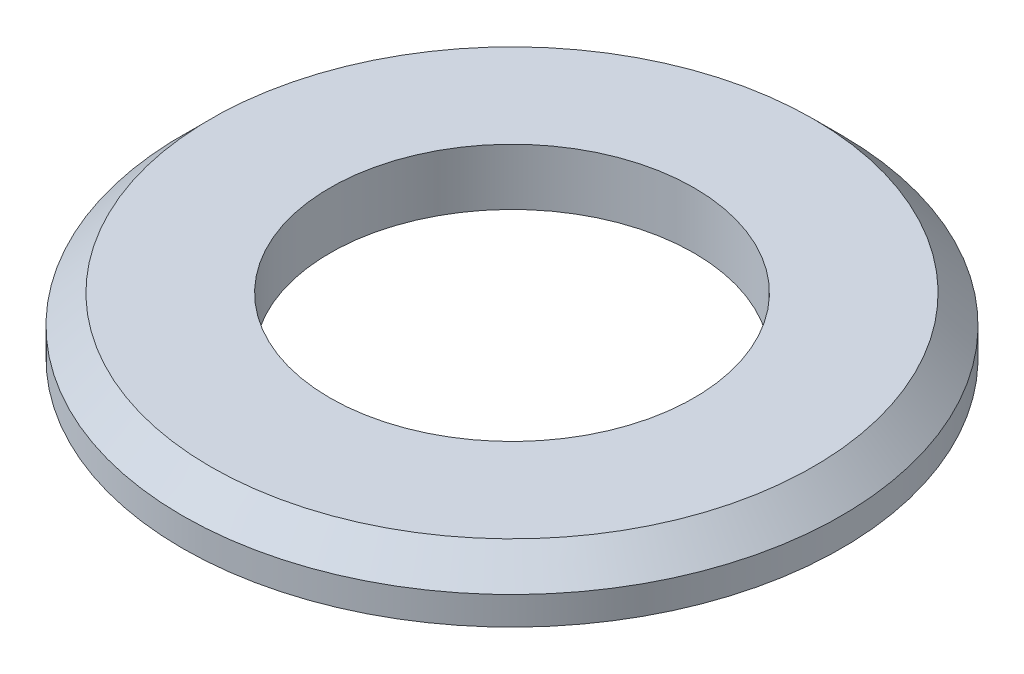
ISO-10303-21;
HEADER;
FILE_DESCRIPTION(('STEP AP214'),'2;1');
FILE_NAME('part.step','',(''),(''),'','','');
FILE_SCHEMA(('AUTOMOTIVE_DESIGN { 1 0 10303 214 1 1 1 1 }'));
ENDSEC;
DATA;
#1=APPLICATION_CONTEXT('core data for automotive mechanical design processes');
#2=APPLICATION_PROTOCOL_DEFINITION('international standard','automotive_design',2000,#1);
#3=PRODUCT_CONTEXT('',#1,'mechanical');
#4=PRODUCT('Part','Part','',(#3));
#5=PRODUCT_RELATED_PRODUCT_CATEGORY('part','',(#4));
#6=PRODUCT_DEFINITION_FORMATION('','',#4);
#7=PRODUCT_DEFINITION_CONTEXT('part definition',#1,'design');
#8=PRODUCT_DEFINITION('design','',#6,#7);
#9=PRODUCT_DEFINITION_SHAPE('','',#8);
#10=(LENGTH_UNIT() NAMED_UNIT(*) SI_UNIT(.MILLI.,.METRE.));
#11=(NAMED_UNIT(*) PLANE_ANGLE_UNIT() SI_UNIT($,.RADIAN.));
#12=(NAMED_UNIT(*) SI_UNIT($,.STERADIAN.) SOLID_ANGLE_UNIT());
#13=UNCERTAINTY_MEASURE_WITH_UNIT(LENGTH_MEASURE(1.E-05),#10,'distance_accuracy_value','');
#14=(GEOMETRIC_REPRESENTATION_CONTEXT(3) GLOBAL_UNCERTAINTY_ASSIGNED_CONTEXT((#13)) GLOBAL_UNIT_ASSIGNED_CONTEXT((#10,
#11,#12)) REPRESENTATION_CONTEXT('',''));
#15=CARTESIAN_POINT('',(0.,0.,0.));
#16=DIRECTION('',(0.,0.,1.));
#17=DIRECTION('',(1.,0.,0.));
#18=AXIS2_PLACEMENT_3D('',#15,#16,#17);
#19=CARTESIAN_POINT('',(0.,9.,0.));
#20=DIRECTION('',(0.,1.,0.));
#21=DIRECTION('',(0.,0.,1.));
#22=AXIS2_PLACEMENT_3D('',#19,#20,#21);
#23=PLANE('',#22);
#24=CARTESIAN_POINT('',(0.,9.,0.));
#25=DIRECTION('',(0.,1.,0.));
#26=DIRECTION('',(0.,0.,1.));
#27=AXIS2_PLACEMENT_3D('',#24,#25,#26);
#28=CIRCLE('',#27,48.);
#29=CARTESIAN_POINT('',(0.,9.,48.));
#30=VERTEX_POINT('',#29);
#31=EDGE_CURVE('E35',#30,#30,#28,.T.);
#32=ORIENTED_EDGE('',*,*,#31,.T.);
#33=EDGE_LOOP('',(#32));
#34=FACE_BOUND('',#33,.T.);
#35=CARTESIAN_POINT('',(0.,9.,0.));
#36=DIRECTION('',(0.,1.,0.));
#37=DIRECTION('',(0.,0.,1.));
#38=AXIS2_PLACEMENT_3D('',#35,#36,#37);
#39=CIRCLE('',#38,29.);
#40=CARTESIAN_POINT('',(0.,9.,29.));
#41=VERTEX_POINT('',#40);
#42=EDGE_CURVE('E43',#41,#41,#39,.T.);
#43=ORIENTED_EDGE('',*,*,#42,.F.);
#44=EDGE_LOOP('',(#43));
#45=FACE_BOUND('',#44,.T.);
#46=ADVANCED_FACE('F28',(#34,#45),#23,.T.);
#47=CARTESIAN_POINT('',(0.,0.,0.));
#48=DIRECTION('',(0.,1.,0.));
#49=DIRECTION('',(0.,0.,1.));
#50=AXIS2_PLACEMENT_3D('',#47,#48,#49);
#51=PLANE('',#50);
#52=CARTESIAN_POINT('',(0.,0.,0.));
#53=DIRECTION('',(0.,1.,0.));
#54=DIRECTION('',(0.,0.,1.));
#55=AXIS2_PLACEMENT_3D('',#52,#53,#54);
#56=CIRCLE('',#55,52.5);
#57=CARTESIAN_POINT('',(0.,0.,52.5));
#58=VERTEX_POINT('',#57);
#59=EDGE_CURVE('E39',#58,#58,#56,.T.);
#60=ORIENTED_EDGE('',*,*,#59,.F.);
#61=EDGE_LOOP('',(#60));
#62=FACE_BOUND('',#61,.T.);
#63=CARTESIAN_POINT('',(0.,0.,0.));
#64=DIRECTION('',(0.,1.,0.));
#65=DIRECTION('',(0.,0.,1.));
#66=AXIS2_PLACEMENT_3D('',#63,#64,#65);
#67=CIRCLE('',#66,29.);
#68=CARTESIAN_POINT('',(0.,0.,29.));
#69=VERTEX_POINT('',#68);
#70=EDGE_CURVE('E48',#69,#69,#67,.T.);
#71=ORIENTED_EDGE('',*,*,#70,.T.);
#72=EDGE_LOOP('',(#71));
#73=FACE_BOUND('',#72,.T.);
#74=ADVANCED_FACE('F52',(#62,#73),#51,.F.);
#75=CARTESIAN_POINT('',(0.,9.,0.));
#76=DIRECTION('',(0.,-1.,0.));
#77=DIRECTION('',(0.,0.,-1.));
#78=AXIS2_PLACEMENT_3D('',#75,#76,#77);
#79=CYLINDRICAL_SURFACE('',#78,52.5);
#80=CARTESIAN_POINT('',(0.,4.5,0.));
#81=DIRECTION('',(0.,1.,0.));
#82=DIRECTION('',(0.,0.,1.));
#83=AXIS2_PLACEMENT_3D('',#80,#81,#82);
#84=CIRCLE('',#83,52.5);
#85=CARTESIAN_POINT('',(0.,4.5,52.5));
#86=VERTEX_POINT('',#85);
#87=EDGE_CURVE('E10',#86,#86,#84,.F.);
#88=ORIENTED_EDGE('',*,*,#87,.T.);
#89=EDGE_LOOP('',(#88));
#90=FACE_BOUND('',#89,.T.);
#91=ORIENTED_EDGE('',*,*,#59,.T.);
#92=EDGE_LOOP('',(#91));
#93=FACE_BOUND('',#92,.T.);
#94=ADVANCED_FACE('F30',(#90,#93),#79,.T.);
#95=CARTESIAN_POINT('',(0.,9.,0.));
#96=DIRECTION('',(0.,-1.,0.));
#97=DIRECTION('',(0.,0.,-1.));
#98=AXIS2_PLACEMENT_3D('',#95,#96,#97);
#99=CYLINDRICAL_SURFACE('',#98,29.);
#100=ORIENTED_EDGE('',*,*,#42,.T.);
#101=EDGE_LOOP('',(#100));
#102=FACE_BOUND('',#101,.T.);
#103=ORIENTED_EDGE('',*,*,#70,.F.);
#104=EDGE_LOOP('',(#103));
#105=FACE_BOUND('',#104,.T.);
#106=ADVANCED_FACE('F54',(#102,#105),#99,.F.);
#107=CARTESIAN_POINT('',(0.,9.,0.));
#108=DIRECTION('',(0.,-1.,0.));
#109=DIRECTION('',(0.,0.,-1.));
#110=AXIS2_PLACEMENT_3D('',#107,#108,#109);
#111=CONICAL_SURFACE('',#110,48.,0.785398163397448);
#112=ORIENTED_EDGE('',*,*,#87,.F.);
#113=EDGE_LOOP('',(#112));
#114=FACE_BOUND('',#113,.T.);
#115=ORIENTED_EDGE('',*,*,#31,.F.);
#116=EDGE_LOOP('',(#115));
#117=FACE_BOUND('',#116,.T.);
#118=ADVANCED_FACE('F56',(#114,#117),#111,.T.);
#119=CLOSED_SHELL('',(#46,#74,#94,#106,#118));
#120=MANIFOLD_SOLID_BREP('B2',#119);
#121=ADVANCED_BREP_SHAPE_REPRESENTATION('',(#18,#120),#14);
#122=SHAPE_DEFINITION_REPRESENTATION(#9,#121);
ENDSEC;
END-ISO-10303-21;
